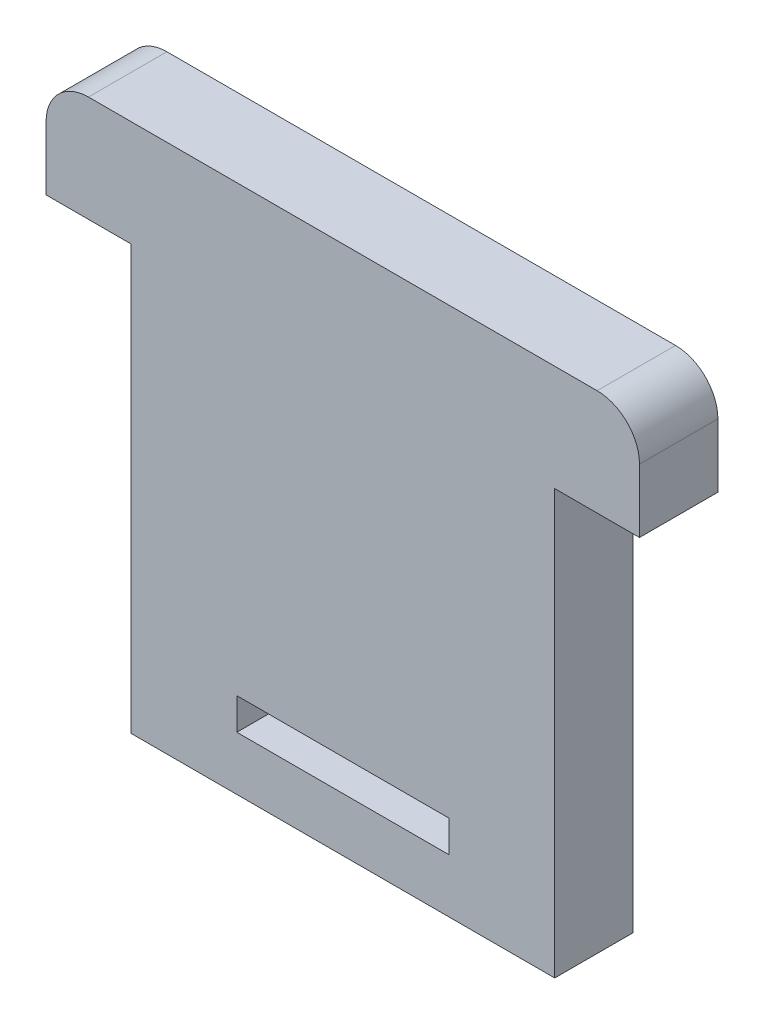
from build123d import *

# Parameters (mm, degrees)
BOSS_EXTRUDE1_DEPTH = 2.3495
SKETCH3_W           = 12.7
SKETCH3_H           = 1.9
CUT_EXTRUDE1_DEPTH  = 27.478510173
FILLET2_R           = 2.54


with BuildPart() as part:
    # Sketch2 → Boss-Extrude1 (new, symmetric)
    with BuildSketch(Plane.XY):
        Polygon((12.7, 12.7), (17.78, 12.7), (17.78, 19.05), (-17.78, 19.05), (-17.78, 12.7), (-12.7, 12.7), (-12.7, -12.7), (12.7, -12.7), align=None)
    extrude(amount=BOSS_EXTRUDE1_DEPTH, both=True)

    # Sketch3 → Cut-Extrude1 (cut, through all)
    with BuildSketch(Plane(origin=(0, 0, -2.3495), x_dir=(-1, 0, 0), z_dir=(0, 0, -1))):
        with Locations((0, -8.521616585)):
            Rectangle(SKETCH3_W, SKETCH3_H)
    extrude(amount=-CUT_EXTRUDE1_DEPTH, mode=Mode.SUBTRACT)

    # Fillet2
    fillet2_edges = [part.edges().sort_by_distance(p)[0] for p in [
        (-17.78, 19.05, 0),
        (17.78, 19.05, 0),
    ]]
    fillet(fillet2_edges, radius=FILLET2_R)


solid = part.part
